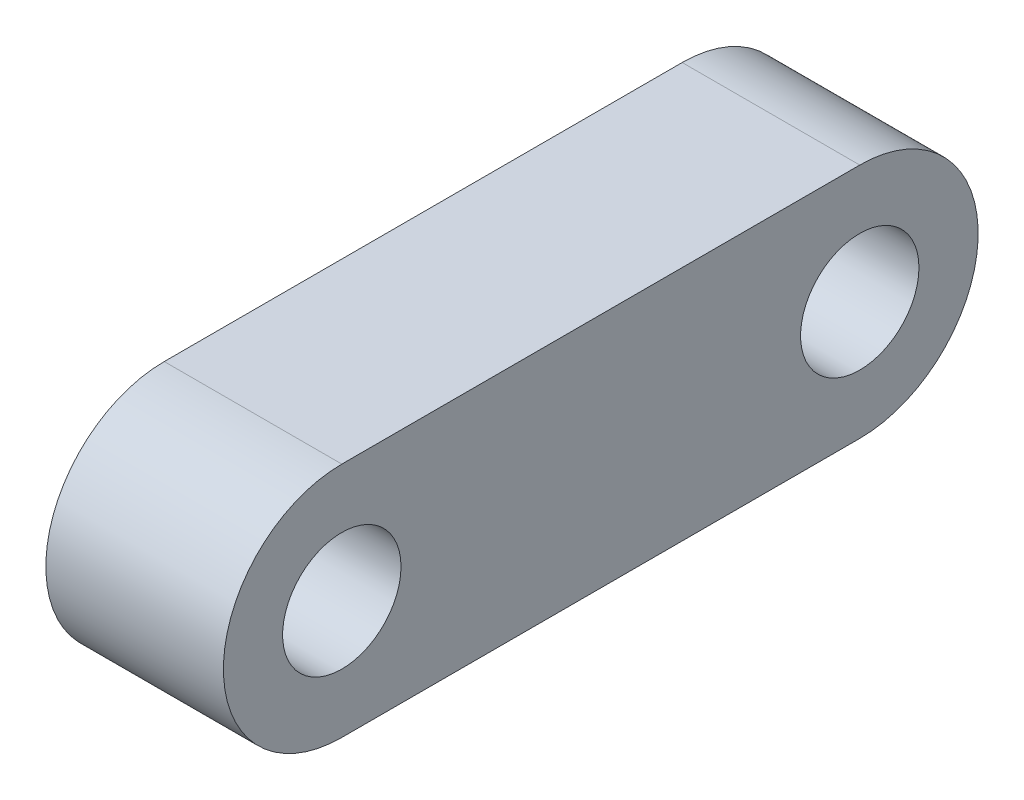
from build123d import *

# Parameters (mm, degrees)
SKETCH1_R           = 20
BOSS_EXTRUDE1_DEPTH = 30


with BuildPart() as part:
    # Sketch1 → Boss-Extrude1 (new, symmetric)
    with BuildSketch(Plane(origin=(0, 0, 0), x_dir=(0, 0, -1), z_dir=(1, 0, 0))):
        with BuildLine():
            Line((-87.5, 40), (87.5, 40))
            ThreePointArc((87.5, 40), (127.5, 0), (87.5, -40))
            Line((87.5, -40), (-87.5, -40))
            ThreePointArc((-87.5, -40), (-127.5, 0), (-87.5, 40))
        make_face()
        with Locations((-87.5, 0)):
            Circle(SKETCH1_R, mode=Mode.SUBTRACT)
        with Locations((87.5, 0)):
            Circle(SKETCH1_R, mode=Mode.SUBTRACT)
    extrude(amount=BOSS_EXTRUDE1_DEPTH, both=True)


solid = part.part
